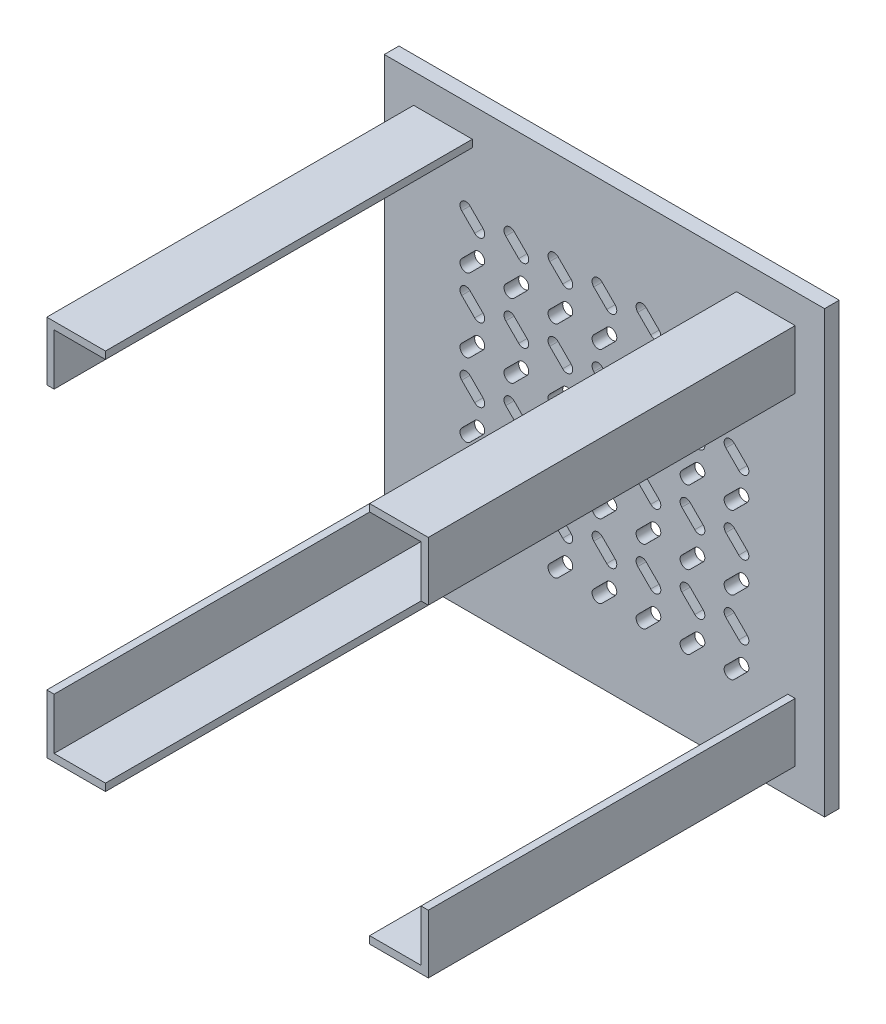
from build123d import *

# Parameters (mm, degrees)
SKETCH2_W               = 300
SKETCH2_H               = 10
BOSS_EXTRUDE1_DEPTH     = 150
BOSS_EXTRUDE2_DEPTH     = 250
CUT_EXTRUDE1_REACH      = 337.559
LPATTERN1_COUNT         = 4
LPATTERN1_PITCH         = 50
LPATTERN2_COUNT         = 7
LPATTERN2_PITCH         = 30
LPATTERN2_COPY_1_REACH  = 337.559
LPATTERN2_COPY_2_REACH  = 337.559
LPATTERN2_COPY_3_REACH  = 337.559
LPATTERN2_COPY_4_REACH  = 337.559
LPATTERN2_COPY_5_REACH  = 337.559
LPATTERN2_COPY_6_REACH  = 337.559
LPATTERN2_COPY_7_REACH  = 337.559
LPATTERN2_COPY_8_REACH  = 337.559
LPATTERN2_COPY_9_REACH  = 337.559
LPATTERN2_COPY_10_REACH = 337.559
LPATTERN2_COPY_11_REACH = 337.559
LPATTERN2_COPY_12_REACH = 337.559
LPATTERN2_COPY_13_REACH = 337.559
LPATTERN2_COPY_14_REACH = 337.559
LPATTERN2_COPY_15_REACH = 337.559
LPATTERN2_COPY_16_REACH = 337.559
LPATTERN2_COPY_17_REACH = 337.559
LPATTERN2_COPY_18_REACH = 337.559


with BuildPart() as part:
    # Sketch2 → Boss-Extrude1 (new, symmetric)
    with BuildSketch(Plane(origin=(0, 0, 0), x_dir=(1, 0, 0), z_dir=(0, 1, 0))):
        with Locations((0, 5)):
            Rectangle(SKETCH2_W, SKETCH2_H)
    extrude(amount=BOSS_EXTRUDE1_DEPTH, both=True)

    # Sketch4 → Boss-Extrude2 (add)
    with BuildSketch(Plane.XY):
        Polygon((130, -90), (130, -130), (90, -130), (90, -125), (125, -125), (125, -90), align=None)
        Polygon((-90, -130), (-90, -125), (-125, -125), (-125, -90), (-130, -90), (-130, -130), align=None)
        Polygon((-90, 130), (-90, 125), (-125, 125), (-125, 90), (-130, 90), (-130, 130), align=None)
        Polygon((130, 130), (90, 130), (90, 125), (125, 125), (125, 90), (130, 90), align=None)
    extrude(amount=BOSS_EXTRUDE2_DEPTH)

    # Sketch5 → Cut-Extrude1 (cut, up to next)
    with BuildSketch(Plane(origin=(0, 0, -10), x_dir=(-1, 0, 0), z_dir=(0, 0, -1)), mode=Mode.PRIVATE) as cut_extrude1_sk1:
        with BuildLine():
            Line((97.247844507, 84.176693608), (88.409009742, 75.337858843))
            ThreePointArc((88.409009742, 75.337858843), (82.752155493, 75.337858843), (82.752155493, 80.994713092))
            Line((82.752155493, 80.994713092), (91.590990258, 89.833547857))
            ThreePointArc((91.590990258, 89.833547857), (97.247844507, 89.833547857), (97.247844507, 84.176693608))
        make_face()
    cut_extrude1_tool1 = extrude(cut_extrude1_sk1.sketch, amount=-CUT_EXTRUDE1_REACH, mode=Mode.PRIVATE) & part.part
    # Sketch5 → Cut-Extrude1 (cut, up to next)
    with BuildSketch(Plane(origin=(0, 0, -10), x_dir=(-1, 0, 0), z_dir=(0, 0, -1)), mode=Mode.PRIVATE) as cut_extrude1_sk2:
        with BuildLine():
            Line((88.409009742, 64.833547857), (97.247844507, 55.994713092))
            ThreePointArc((97.247844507, 55.994713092), (97.247844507, 50.337858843), (91.590990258, 50.337858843))
            Line((91.590990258, 50.337858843), (82.752155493, 59.176693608))
            ThreePointArc((82.752155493, 59.176693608), (82.752155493, 64.833547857), (88.409009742, 64.833547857))
        make_face()
    cut_extrude1_tool2 = extrude(cut_extrude1_sk2.sketch, amount=-CUT_EXTRUDE1_REACH, mode=Mode.PRIVATE) & part.part
    cut_extrude1_1 = cut_extrude1_tool1.solids().sort_by_distance((-90, 82.585703, -10))[0]
    add(cut_extrude1_1, mode=Mode.SUBTRACT)
    cut_extrude1_2 = cut_extrude1_tool2.solids().sort_by_distance((-90, 57.585703, -10))[0]
    add(cut_extrude1_2, mode=Mode.SUBTRACT)
    cut_extrude1 = cut_extrude1_1 + cut_extrude1_2  # Cut-Extrude1 as one shape, for the pattern or mirror that repeats it

    # LPattern1: Cut-Extrude1 ×4
    with Locations(*[(0, -i * LPATTERN1_PITCH, 0) for i in range(1, LPATTERN1_COUNT)]):
        add(cut_extrude1, mode=Mode.SUBTRACT)

    # LPattern2: Cut-Extrude1 ×7
    with Locations(*[(i * LPATTERN2_PITCH, 0, 0) for i in range(1, LPATTERN2_COUNT)]):
        add(cut_extrude1, mode=Mode.SUBTRACT)

    # LPattern2 copy 1 sketch → LPattern2 copy 1 (cut, up to next)
    with BuildSketch(Plane(origin=(30, -50, -10), x_dir=(-1, 0, 0), z_dir=(0, 0, -1)), mode=Mode.PRIVATE) as lpattern2_copy_1_sk1:
        with BuildLine():
            Line((97.247844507, 84.176693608), (88.409009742, 75.337858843))
            ThreePointArc((88.409009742, 75.337858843), (82.752155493, 75.337858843), (82.752155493, 80.994713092))
            Line((82.752155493, 80.994713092), (91.590990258, 89.833547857))
            ThreePointArc((91.590990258, 89.833547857), (97.247844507, 89.833547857), (97.247844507, 84.176693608))
        make_face()
    lpattern2_copy_1_tool1 = extrude(lpattern2_copy_1_sk1.sketch, amount=-LPATTERN2_COPY_1_REACH, mode=Mode.PRIVATE) & part.part
    # LPattern2 copy 1 sketch → LPattern2 copy 1 (cut, up to next)
    with BuildSketch(Plane(origin=(30, -50, -10), x_dir=(-1, 0, 0), z_dir=(0, 0, -1)), mode=Mode.PRIVATE) as lpattern2_copy_1_sk2:
        with BuildLine():
            Line((88.409009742, 64.833547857), (97.247844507, 55.994713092))
            ThreePointArc((97.247844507, 55.994713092), (97.247844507, 50.337858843), (91.590990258, 50.337858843))
            Line((91.590990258, 50.337858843), (82.752155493, 59.176693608))
            ThreePointArc((82.752155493, 59.176693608), (82.752155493, 64.833547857), (88.409009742, 64.833547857))
        make_face()
    lpattern2_copy_1_tool2 = extrude(lpattern2_copy_1_sk2.sketch, amount=-LPATTERN2_COPY_1_REACH, mode=Mode.PRIVATE) & part.part
    add(lpattern2_copy_1_tool1.solids().sort_by_distance((-60, 32.585703, -10))[0], mode=Mode.SUBTRACT)
    add(lpattern2_copy_1_tool2.solids().sort_by_distance((-60, 7.585703, -10))[0], mode=Mode.SUBTRACT)

    # LPattern2 copy 2 sketch → LPattern2 copy 2 (cut, up to next)
    with BuildSketch(Plane(origin=(60, -50, -10), x_dir=(-1, 0, 0), z_dir=(0, 0, -1)), mode=Mode.PRIVATE) as lpattern2_copy_2_sk1:
        with BuildLine():
            Line((97.247844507, 84.176693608), (88.409009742, 75.337858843))
            ThreePointArc((88.409009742, 75.337858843), (82.752155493, 75.337858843), (82.752155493, 80.994713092))
            Line((82.752155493, 80.994713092), (91.590990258, 89.833547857))
            ThreePointArc((91.590990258, 89.833547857), (97.247844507, 89.833547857), (97.247844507, 84.176693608))
        make_face()
    lpattern2_copy_2_tool1 = extrude(lpattern2_copy_2_sk1.sketch, amount=-LPATTERN2_COPY_2_REACH, mode=Mode.PRIVATE) & part.part
    # LPattern2 copy 2 sketch → LPattern2 copy 2 (cut, up to next)
    with BuildSketch(Plane(origin=(60, -50, -10), x_dir=(-1, 0, 0), z_dir=(0, 0, -1)), mode=Mode.PRIVATE) as lpattern2_copy_2_sk2:
        with BuildLine():
            Line((88.409009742, 64.833547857), (97.247844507, 55.994713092))
            ThreePointArc((97.247844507, 55.994713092), (97.247844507, 50.337858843), (91.590990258, 50.337858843))
            Line((91.590990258, 50.337858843), (82.752155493, 59.176693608))
            ThreePointArc((82.752155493, 59.176693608), (82.752155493, 64.833547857), (88.409009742, 64.833547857))
        make_face()
    lpattern2_copy_2_tool2 = extrude(lpattern2_copy_2_sk2.sketch, amount=-LPATTERN2_COPY_2_REACH, mode=Mode.PRIVATE) & part.part
    add(lpattern2_copy_2_tool1.solids().sort_by_distance((-30, 32.585703, -10))[0], mode=Mode.SUBTRACT)
    add(lpattern2_copy_2_tool2.solids().sort_by_distance((-30, 7.585703, -10))[0], mode=Mode.SUBTRACT)

    # LPattern2 copy 3 sketch → LPattern2 copy 3 (cut, up to next)
    with BuildSketch(Plane(origin=(90, -50, -10), x_dir=(-1, 0, 0), z_dir=(0, 0, -1)), mode=Mode.PRIVATE) as lpattern2_copy_3_sk1:
        with BuildLine():
            Line((97.247844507, 84.176693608), (88.409009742, 75.337858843))
            ThreePointArc((88.409009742, 75.337858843), (82.752155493, 75.337858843), (82.752155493, 80.994713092))
            Line((82.752155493, 80.994713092), (91.590990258, 89.833547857))
            ThreePointArc((91.590990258, 89.833547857), (97.247844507, 89.833547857), (97.247844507, 84.176693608))
        make_face()
    lpattern2_copy_3_tool1 = extrude(lpattern2_copy_3_sk1.sketch, amount=-LPATTERN2_COPY_3_REACH, mode=Mode.PRIVATE) & part.part
    # LPattern2 copy 3 sketch → LPattern2 copy 3 (cut, up to next)
    with BuildSketch(Plane(origin=(90, -50, -10), x_dir=(-1, 0, 0), z_dir=(0, 0, -1)), mode=Mode.PRIVATE) as lpattern2_copy_3_sk2:
        with BuildLine():
            Line((88.409009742, 64.833547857), (97.247844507, 55.994713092))
            ThreePointArc((97.247844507, 55.994713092), (97.247844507, 50.337858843), (91.590990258, 50.337858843))
            Line((91.590990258, 50.337858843), (82.752155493, 59.176693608))
            ThreePointArc((82.752155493, 59.176693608), (82.752155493, 64.833547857), (88.409009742, 64.833547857))
        make_face()
    lpattern2_copy_3_tool2 = extrude(lpattern2_copy_3_sk2.sketch, amount=-LPATTERN2_COPY_3_REACH, mode=Mode.PRIVATE) & part.part
    add(lpattern2_copy_3_tool1.solids().sort_by_distance((0, 32.585703, -10))[0], mode=Mode.SUBTRACT)
    add(lpattern2_copy_3_tool2.solids().sort_by_distance((0, 7.585703, -10))[0], mode=Mode.SUBTRACT)

    # LPattern2 copy 4 sketch → LPattern2 copy 4 (cut, up to next)
    with BuildSketch(Plane(origin=(120, -50, -10), x_dir=(-1, 0, 0), z_dir=(0, 0, -1)), mode=Mode.PRIVATE) as lpattern2_copy_4_sk1:
        with BuildLine():
            Line((97.247844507, 84.176693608), (88.409009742, 75.337858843))
            ThreePointArc((88.409009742, 75.337858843), (82.752155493, 75.337858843), (82.752155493, 80.994713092))
            Line((82.752155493, 80.994713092), (91.590990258, 89.833547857))
            ThreePointArc((91.590990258, 89.833547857), (97.247844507, 89.833547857), (97.247844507, 84.176693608))
        make_face()
    lpattern2_copy_4_tool1 = extrude(lpattern2_copy_4_sk1.sketch, amount=-LPATTERN2_COPY_4_REACH, mode=Mode.PRIVATE) & part.part
    # LPattern2 copy 4 sketch → LPattern2 copy 4 (cut, up to next)
    with BuildSketch(Plane(origin=(120, -50, -10), x_dir=(-1, 0, 0), z_dir=(0, 0, -1)), mode=Mode.PRIVATE) as lpattern2_copy_4_sk2:
        with BuildLine():
            Line((88.409009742, 64.833547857), (97.247844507, 55.994713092))
            ThreePointArc((97.247844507, 55.994713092), (97.247844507, 50.337858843), (91.590990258, 50.337858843))
            Line((91.590990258, 50.337858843), (82.752155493, 59.176693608))
            ThreePointArc((82.752155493, 59.176693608), (82.752155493, 64.833547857), (88.409009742, 64.833547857))
        make_face()
    lpattern2_copy_4_tool2 = extrude(lpattern2_copy_4_sk2.sketch, amount=-LPATTERN2_COPY_4_REACH, mode=Mode.PRIVATE) & part.part
    add(lpattern2_copy_4_tool1.solids().sort_by_distance((30, 32.585703, -10))[0], mode=Mode.SUBTRACT)
    add(lpattern2_copy_4_tool2.solids().sort_by_distance((30, 7.585703, -10))[0], mode=Mode.SUBTRACT)

    # LPattern2 copy 5 sketch → LPattern2 copy 5 (cut, up to next)
    with BuildSketch(Plane(origin=(150, -50, -10), x_dir=(-1, 0, 0), z_dir=(0, 0, -1)), mode=Mode.PRIVATE) as lpattern2_copy_5_sk1:
        with BuildLine():
            Line((97.247844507, 84.176693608), (88.409009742, 75.337858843))
            ThreePointArc((88.409009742, 75.337858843), (82.752155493, 75.337858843), (82.752155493, 80.994713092))
            Line((82.752155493, 80.994713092), (91.590990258, 89.833547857))
            ThreePointArc((91.590990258, 89.833547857), (97.247844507, 89.833547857), (97.247844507, 84.176693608))
        make_face()
    lpattern2_copy_5_tool1 = extrude(lpattern2_copy_5_sk1.sketch, amount=-LPATTERN2_COPY_5_REACH, mode=Mode.PRIVATE) & part.part
    # LPattern2 copy 5 sketch → LPattern2 copy 5 (cut, up to next)
    with BuildSketch(Plane(origin=(150, -50, -10), x_dir=(-1, 0, 0), z_dir=(0, 0, -1)), mode=Mode.PRIVATE) as lpattern2_copy_5_sk2:
        with BuildLine():
            Line((88.409009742, 64.833547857), (97.247844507, 55.994713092))
            ThreePointArc((97.247844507, 55.994713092), (97.247844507, 50.337858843), (91.590990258, 50.337858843))
            Line((91.590990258, 50.337858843), (82.752155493, 59.176693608))
            ThreePointArc((82.752155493, 59.176693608), (82.752155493, 64.833547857), (88.409009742, 64.833547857))
        make_face()
    lpattern2_copy_5_tool2 = extrude(lpattern2_copy_5_sk2.sketch, amount=-LPATTERN2_COPY_5_REACH, mode=Mode.PRIVATE) & part.part
    add(lpattern2_copy_5_tool1.solids().sort_by_distance((60, 32.585703, -10))[0], mode=Mode.SUBTRACT)
    add(lpattern2_copy_5_tool2.solids().sort_by_distance((60, 7.585703, -10))[0], mode=Mode.SUBTRACT)

    # LPattern2 copy 6 sketch → LPattern2 copy 6 (cut, up to next)
    with BuildSketch(Plane(origin=(180, -50, -10), x_dir=(-1, 0, 0), z_dir=(0, 0, -1)), mode=Mode.PRIVATE) as lpattern2_copy_6_sk1:
        with BuildLine():
            Line((97.247844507, 84.176693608), (88.409009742, 75.337858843))
            ThreePointArc((88.409009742, 75.337858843), (82.752155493, 75.337858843), (82.752155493, 80.994713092))
            Line((82.752155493, 80.994713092), (91.590990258, 89.833547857))
            ThreePointArc((91.590990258, 89.833547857), (97.247844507, 89.833547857), (97.247844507, 84.176693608))
        make_face()
    lpattern2_copy_6_tool1 = extrude(lpattern2_copy_6_sk1.sketch, amount=-LPATTERN2_COPY_6_REACH, mode=Mode.PRIVATE) & part.part
    # LPattern2 copy 6 sketch → LPattern2 copy 6 (cut, up to next)
    with BuildSketch(Plane(origin=(180, -50, -10), x_dir=(-1, 0, 0), z_dir=(0, 0, -1)), mode=Mode.PRIVATE) as lpattern2_copy_6_sk2:
        with BuildLine():
            Line((88.409009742, 64.833547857), (97.247844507, 55.994713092))
            ThreePointArc((97.247844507, 55.994713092), (97.247844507, 50.337858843), (91.590990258, 50.337858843))
            Line((91.590990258, 50.337858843), (82.752155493, 59.176693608))
            ThreePointArc((82.752155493, 59.176693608), (82.752155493, 64.833547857), (88.409009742, 64.833547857))
        make_face()
    lpattern2_copy_6_tool2 = extrude(lpattern2_copy_6_sk2.sketch, amount=-LPATTERN2_COPY_6_REACH, mode=Mode.PRIVATE) & part.part
    add(lpattern2_copy_6_tool1.solids().sort_by_distance((90, 32.585703, -10))[0], mode=Mode.SUBTRACT)
    add(lpattern2_copy_6_tool2.solids().sort_by_distance((90, 7.585703, -10))[0], mode=Mode.SUBTRACT)

    # LPattern2 copy 7 sketch → LPattern2 copy 7 (cut, up to next)
    with BuildSketch(Plane(origin=(30, -100, -10), x_dir=(-1, 0, 0), z_dir=(0, 0, -1)), mode=Mode.PRIVATE) as lpattern2_copy_7_sk1:
        with BuildLine():
            Line((97.247844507, 84.176693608), (88.409009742, 75.337858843))
            ThreePointArc((88.409009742, 75.337858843), (82.752155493, 75.337858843), (82.752155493, 80.994713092))
            Line((82.752155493, 80.994713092), (91.590990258, 89.833547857))
            ThreePointArc((91.590990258, 89.833547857), (97.247844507, 89.833547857), (97.247844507, 84.176693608))
        make_face()
    lpattern2_copy_7_tool1 = extrude(lpattern2_copy_7_sk1.sketch, amount=-LPATTERN2_COPY_7_REACH, mode=Mode.PRIVATE) & part.part
    # LPattern2 copy 7 sketch → LPattern2 copy 7 (cut, up to next)
    with BuildSketch(Plane(origin=(30, -100, -10), x_dir=(-1, 0, 0), z_dir=(0, 0, -1)), mode=Mode.PRIVATE) as lpattern2_copy_7_sk2:
        with BuildLine():
            Line((88.409009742, 64.833547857), (97.247844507, 55.994713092))
            ThreePointArc((97.247844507, 55.994713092), (97.247844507, 50.337858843), (91.590990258, 50.337858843))
            Line((91.590990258, 50.337858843), (82.752155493, 59.176693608))
            ThreePointArc((82.752155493, 59.176693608), (82.752155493, 64.833547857), (88.409009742, 64.833547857))
        make_face()
    lpattern2_copy_7_tool2 = extrude(lpattern2_copy_7_sk2.sketch, amount=-LPATTERN2_COPY_7_REACH, mode=Mode.PRIVATE) & part.part
    add(lpattern2_copy_7_tool1.solids().sort_by_distance((-60, -17.414297, -10))[0], mode=Mode.SUBTRACT)
    add(lpattern2_copy_7_tool2.solids().sort_by_distance((-60, -42.414297, -10))[0], mode=Mode.SUBTRACT)

    # LPattern2 copy 8 sketch → LPattern2 copy 8 (cut, up to next)
    with BuildSketch(Plane(origin=(60, -100, -10), x_dir=(-1, 0, 0), z_dir=(0, 0, -1)), mode=Mode.PRIVATE) as lpattern2_copy_8_sk1:
        with BuildLine():
            Line((97.247844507, 84.176693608), (88.409009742, 75.337858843))
            ThreePointArc((88.409009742, 75.337858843), (82.752155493, 75.337858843), (82.752155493, 80.994713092))
            Line((82.752155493, 80.994713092), (91.590990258, 89.833547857))
            ThreePointArc((91.590990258, 89.833547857), (97.247844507, 89.833547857), (97.247844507, 84.176693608))
        make_face()
    lpattern2_copy_8_tool1 = extrude(lpattern2_copy_8_sk1.sketch, amount=-LPATTERN2_COPY_8_REACH, mode=Mode.PRIVATE) & part.part
    # LPattern2 copy 8 sketch → LPattern2 copy 8 (cut, up to next)
    with BuildSketch(Plane(origin=(60, -100, -10), x_dir=(-1, 0, 0), z_dir=(0, 0, -1)), mode=Mode.PRIVATE) as lpattern2_copy_8_sk2:
        with BuildLine():
            Line((88.409009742, 64.833547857), (97.247844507, 55.994713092))
            ThreePointArc((97.247844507, 55.994713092), (97.247844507, 50.337858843), (91.590990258, 50.337858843))
            Line((91.590990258, 50.337858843), (82.752155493, 59.176693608))
            ThreePointArc((82.752155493, 59.176693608), (82.752155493, 64.833547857), (88.409009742, 64.833547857))
        make_face()
    lpattern2_copy_8_tool2 = extrude(lpattern2_copy_8_sk2.sketch, amount=-LPATTERN2_COPY_8_REACH, mode=Mode.PRIVATE) & part.part
    add(lpattern2_copy_8_tool1.solids().sort_by_distance((-30, -17.414297, -10))[0], mode=Mode.SUBTRACT)
    add(lpattern2_copy_8_tool2.solids().sort_by_distance((-30, -42.414297, -10))[0], mode=Mode.SUBTRACT)

    # LPattern2 copy 9 sketch → LPattern2 copy 9 (cut, up to next)
    with BuildSketch(Plane(origin=(90, -100, -10), x_dir=(-1, 0, 0), z_dir=(0, 0, -1)), mode=Mode.PRIVATE) as lpattern2_copy_9_sk1:
        with BuildLine():
            Line((97.247844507, 84.176693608), (88.409009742, 75.337858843))
            ThreePointArc((88.409009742, 75.337858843), (82.752155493, 75.337858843), (82.752155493, 80.994713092))
            Line((82.752155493, 80.994713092), (91.590990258, 89.833547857))
            ThreePointArc((91.590990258, 89.833547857), (97.247844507, 89.833547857), (97.247844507, 84.176693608))
        make_face()
    lpattern2_copy_9_tool1 = extrude(lpattern2_copy_9_sk1.sketch, amount=-LPATTERN2_COPY_9_REACH, mode=Mode.PRIVATE) & part.part
    # LPattern2 copy 9 sketch → LPattern2 copy 9 (cut, up to next)
    with BuildSketch(Plane(origin=(90, -100, -10), x_dir=(-1, 0, 0), z_dir=(0, 0, -1)), mode=Mode.PRIVATE) as lpattern2_copy_9_sk2:
        with BuildLine():
            Line((88.409009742, 64.833547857), (97.247844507, 55.994713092))
            ThreePointArc((97.247844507, 55.994713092), (97.247844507, 50.337858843), (91.590990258, 50.337858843))
            Line((91.590990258, 50.337858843), (82.752155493, 59.176693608))
            ThreePointArc((82.752155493, 59.176693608), (82.752155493, 64.833547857), (88.409009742, 64.833547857))
        make_face()
    lpattern2_copy_9_tool2 = extrude(lpattern2_copy_9_sk2.sketch, amount=-LPATTERN2_COPY_9_REACH, mode=Mode.PRIVATE) & part.part
    add(lpattern2_copy_9_tool1.solids().sort_by_distance((0, -17.414297, -10))[0], mode=Mode.SUBTRACT)
    add(lpattern2_copy_9_tool2.solids().sort_by_distance((0, -42.414297, -10))[0], mode=Mode.SUBTRACT)

    # LPattern2 copy 10 sketch → LPattern2 copy 10 (cut, up to next)
    with BuildSketch(Plane(origin=(120, -100, -10), x_dir=(-1, 0, 0), z_dir=(0, 0, -1)), mode=Mode.PRIVATE) as lpattern2_copy_10_sk1:
        with BuildLine():
            Line((97.247844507, 84.176693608), (88.409009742, 75.337858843))
            ThreePointArc((88.409009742, 75.337858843), (82.752155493, 75.337858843), (82.752155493, 80.994713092))
            Line((82.752155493, 80.994713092), (91.590990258, 89.833547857))
            ThreePointArc((91.590990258, 89.833547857), (97.247844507, 89.833547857), (97.247844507, 84.176693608))
        make_face()
    lpattern2_copy_10_tool1 = extrude(lpattern2_copy_10_sk1.sketch, amount=-LPATTERN2_COPY_10_REACH, mode=Mode.PRIVATE) & part.part
    # LPattern2 copy 10 sketch → LPattern2 copy 10 (cut, up to next)
    with BuildSketch(Plane(origin=(120, -100, -10), x_dir=(-1, 0, 0), z_dir=(0, 0, -1)), mode=Mode.PRIVATE) as lpattern2_copy_10_sk2:
        with BuildLine():
            Line((88.409009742, 64.833547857), (97.247844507, 55.994713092))
            ThreePointArc((97.247844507, 55.994713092), (97.247844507, 50.337858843), (91.590990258, 50.337858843))
            Line((91.590990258, 50.337858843), (82.752155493, 59.176693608))
            ThreePointArc((82.752155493, 59.176693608), (82.752155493, 64.833547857), (88.409009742, 64.833547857))
        make_face()
    lpattern2_copy_10_tool2 = extrude(lpattern2_copy_10_sk2.sketch, amount=-LPATTERN2_COPY_10_REACH, mode=Mode.PRIVATE) & part.part
    add(lpattern2_copy_10_tool1.solids().sort_by_distance((30, -17.414297, -10))[0], mode=Mode.SUBTRACT)
    add(lpattern2_copy_10_tool2.solids().sort_by_distance((30, -42.414297, -10))[0], mode=Mode.SUBTRACT)

    # LPattern2 copy 11 sketch → LPattern2 copy 11 (cut, up to next)
    with BuildSketch(Plane(origin=(150, -100, -10), x_dir=(-1, 0, 0), z_dir=(0, 0, -1)), mode=Mode.PRIVATE) as lpattern2_copy_11_sk1:
        with BuildLine():
            Line((97.247844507, 84.176693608), (88.409009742, 75.337858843))
            ThreePointArc((88.409009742, 75.337858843), (82.752155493, 75.337858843), (82.752155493, 80.994713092))
            Line((82.752155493, 80.994713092), (91.590990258, 89.833547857))
            ThreePointArc((91.590990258, 89.833547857), (97.247844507, 89.833547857), (97.247844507, 84.176693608))
        make_face()
    lpattern2_copy_11_tool1 = extrude(lpattern2_copy_11_sk1.sketch, amount=-LPATTERN2_COPY_11_REACH, mode=Mode.PRIVATE) & part.part
    # LPattern2 copy 11 sketch → LPattern2 copy 11 (cut, up to next)
    with BuildSketch(Plane(origin=(150, -100, -10), x_dir=(-1, 0, 0), z_dir=(0, 0, -1)), mode=Mode.PRIVATE) as lpattern2_copy_11_sk2:
        with BuildLine():
            Line((88.409009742, 64.833547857), (97.247844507, 55.994713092))
            ThreePointArc((97.247844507, 55.994713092), (97.247844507, 50.337858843), (91.590990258, 50.337858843))
            Line((91.590990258, 50.337858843), (82.752155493, 59.176693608))
            ThreePointArc((82.752155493, 59.176693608), (82.752155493, 64.833547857), (88.409009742, 64.833547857))
        make_face()
    lpattern2_copy_11_tool2 = extrude(lpattern2_copy_11_sk2.sketch, amount=-LPATTERN2_COPY_11_REACH, mode=Mode.PRIVATE) & part.part
    add(lpattern2_copy_11_tool1.solids().sort_by_distance((60, -17.414297, -10))[0], mode=Mode.SUBTRACT)
    add(lpattern2_copy_11_tool2.solids().sort_by_distance((60, -42.414297, -10))[0], mode=Mode.SUBTRACT)

    # LPattern2 copy 12 sketch → LPattern2 copy 12 (cut, up to next)
    with BuildSketch(Plane(origin=(180, -100, -10), x_dir=(-1, 0, 0), z_dir=(0, 0, -1)), mode=Mode.PRIVATE) as lpattern2_copy_12_sk1:
        with BuildLine():
            Line((97.247844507, 84.176693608), (88.409009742, 75.337858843))
            ThreePointArc((88.409009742, 75.337858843), (82.752155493, 75.337858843), (82.752155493, 80.994713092))
            Line((82.752155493, 80.994713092), (91.590990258, 89.833547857))
            ThreePointArc((91.590990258, 89.833547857), (97.247844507, 89.833547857), (97.247844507, 84.176693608))
        make_face()
    lpattern2_copy_12_tool1 = extrude(lpattern2_copy_12_sk1.sketch, amount=-LPATTERN2_COPY_12_REACH, mode=Mode.PRIVATE) & part.part
    # LPattern2 copy 12 sketch → LPattern2 copy 12 (cut, up to next)
    with BuildSketch(Plane(origin=(180, -100, -10), x_dir=(-1, 0, 0), z_dir=(0, 0, -1)), mode=Mode.PRIVATE) as lpattern2_copy_12_sk2:
        with BuildLine():
            Line((88.409009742, 64.833547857), (97.247844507, 55.994713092))
            ThreePointArc((97.247844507, 55.994713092), (97.247844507, 50.337858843), (91.590990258, 50.337858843))
            Line((91.590990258, 50.337858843), (82.752155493, 59.176693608))
            ThreePointArc((82.752155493, 59.176693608), (82.752155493, 64.833547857), (88.409009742, 64.833547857))
        make_face()
    lpattern2_copy_12_tool2 = extrude(lpattern2_copy_12_sk2.sketch, amount=-LPATTERN2_COPY_12_REACH, mode=Mode.PRIVATE) & part.part
    add(lpattern2_copy_12_tool1.solids().sort_by_distance((90, -17.414297, -10))[0], mode=Mode.SUBTRACT)
    add(lpattern2_copy_12_tool2.solids().sort_by_distance((90, -42.414297, -10))[0], mode=Mode.SUBTRACT)

    # LPattern2 copy 13 sketch → LPattern2 copy 13 (cut, up to next)
    with BuildSketch(Plane(origin=(30, -150, -10), x_dir=(-1, 0, 0), z_dir=(0, 0, -1)), mode=Mode.PRIVATE) as lpattern2_copy_13_sk1:
        with BuildLine():
            Line((97.247844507, 84.176693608), (88.409009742, 75.337858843))
            ThreePointArc((88.409009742, 75.337858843), (82.752155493, 75.337858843), (82.752155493, 80.994713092))
            Line((82.752155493, 80.994713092), (91.590990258, 89.833547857))
            ThreePointArc((91.590990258, 89.833547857), (97.247844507, 89.833547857), (97.247844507, 84.176693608))
        make_face()
    lpattern2_copy_13_tool1 = extrude(lpattern2_copy_13_sk1.sketch, amount=-LPATTERN2_COPY_13_REACH, mode=Mode.PRIVATE) & part.part
    # LPattern2 copy 13 sketch → LPattern2 copy 13 (cut, up to next)
    with BuildSketch(Plane(origin=(30, -150, -10), x_dir=(-1, 0, 0), z_dir=(0, 0, -1)), mode=Mode.PRIVATE) as lpattern2_copy_13_sk2:
        with BuildLine():
            Line((88.409009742, 64.833547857), (97.247844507, 55.994713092))
            ThreePointArc((97.247844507, 55.994713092), (97.247844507, 50.337858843), (91.590990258, 50.337858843))
            Line((91.590990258, 50.337858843), (82.752155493, 59.176693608))
            ThreePointArc((82.752155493, 59.176693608), (82.752155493, 64.833547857), (88.409009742, 64.833547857))
        make_face()
    lpattern2_copy_13_tool2 = extrude(lpattern2_copy_13_sk2.sketch, amount=-LPATTERN2_COPY_13_REACH, mode=Mode.PRIVATE) & part.part
    add(lpattern2_copy_13_tool1.solids().sort_by_distance((-60, -67.414297, -10))[0], mode=Mode.SUBTRACT)
    add(lpattern2_copy_13_tool2.solids().sort_by_distance((-60, -92.414297, -10))[0], mode=Mode.SUBTRACT)

    # LPattern2 copy 14 sketch → LPattern2 copy 14 (cut, up to next)
    with BuildSketch(Plane(origin=(60, -150, -10), x_dir=(-1, 0, 0), z_dir=(0, 0, -1)), mode=Mode.PRIVATE) as lpattern2_copy_14_sk1:
        with BuildLine():
            Line((97.247844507, 84.176693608), (88.409009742, 75.337858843))
            ThreePointArc((88.409009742, 75.337858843), (82.752155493, 75.337858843), (82.752155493, 80.994713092))
            Line((82.752155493, 80.994713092), (91.590990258, 89.833547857))
            ThreePointArc((91.590990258, 89.833547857), (97.247844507, 89.833547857), (97.247844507, 84.176693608))
        make_face()
    lpattern2_copy_14_tool1 = extrude(lpattern2_copy_14_sk1.sketch, amount=-LPATTERN2_COPY_14_REACH, mode=Mode.PRIVATE) & part.part
    # LPattern2 copy 14 sketch → LPattern2 copy 14 (cut, up to next)
    with BuildSketch(Plane(origin=(60, -150, -10), x_dir=(-1, 0, 0), z_dir=(0, 0, -1)), mode=Mode.PRIVATE) as lpattern2_copy_14_sk2:
        with BuildLine():
            Line((88.409009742, 64.833547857), (97.247844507, 55.994713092))
            ThreePointArc((97.247844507, 55.994713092), (97.247844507, 50.337858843), (91.590990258, 50.337858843))
            Line((91.590990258, 50.337858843), (82.752155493, 59.176693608))
            ThreePointArc((82.752155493, 59.176693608), (82.752155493, 64.833547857), (88.409009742, 64.833547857))
        make_face()
    lpattern2_copy_14_tool2 = extrude(lpattern2_copy_14_sk2.sketch, amount=-LPATTERN2_COPY_14_REACH, mode=Mode.PRIVATE) & part.part
    add(lpattern2_copy_14_tool1.solids().sort_by_distance((-30, -67.414297, -10))[0], mode=Mode.SUBTRACT)
    add(lpattern2_copy_14_tool2.solids().sort_by_distance((-30, -92.414297, -10))[0], mode=Mode.SUBTRACT)

    # LPattern2 copy 15 sketch → LPattern2 copy 15 (cut, up to next)
    with BuildSketch(Plane(origin=(90, -150, -10), x_dir=(-1, 0, 0), z_dir=(0, 0, -1)), mode=Mode.PRIVATE) as lpattern2_copy_15_sk1:
        with BuildLine():
            Line((97.247844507, 84.176693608), (88.409009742, 75.337858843))
            ThreePointArc((88.409009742, 75.337858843), (82.752155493, 75.337858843), (82.752155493, 80.994713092))
            Line((82.752155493, 80.994713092), (91.590990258, 89.833547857))
            ThreePointArc((91.590990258, 89.833547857), (97.247844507, 89.833547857), (97.247844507, 84.176693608))
        make_face()
    lpattern2_copy_15_tool1 = extrude(lpattern2_copy_15_sk1.sketch, amount=-LPATTERN2_COPY_15_REACH, mode=Mode.PRIVATE) & part.part
    # LPattern2 copy 15 sketch → LPattern2 copy 15 (cut, up to next)
    with BuildSketch(Plane(origin=(90, -150, -10), x_dir=(-1, 0, 0), z_dir=(0, 0, -1)), mode=Mode.PRIVATE) as lpattern2_copy_15_sk2:
        with BuildLine():
            Line((88.409009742, 64.833547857), (97.247844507, 55.994713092))
            ThreePointArc((97.247844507, 55.994713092), (97.247844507, 50.337858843), (91.590990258, 50.337858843))
            Line((91.590990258, 50.337858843), (82.752155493, 59.176693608))
            ThreePointArc((82.752155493, 59.176693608), (82.752155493, 64.833547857), (88.409009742, 64.833547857))
        make_face()
    lpattern2_copy_15_tool2 = extrude(lpattern2_copy_15_sk2.sketch, amount=-LPATTERN2_COPY_15_REACH, mode=Mode.PRIVATE) & part.part
    add(lpattern2_copy_15_tool1.solids().sort_by_distance((0, -67.414297, -10))[0], mode=Mode.SUBTRACT)
    add(lpattern2_copy_15_tool2.solids().sort_by_distance((0, -92.414297, -10))[0], mode=Mode.SUBTRACT)

    # LPattern2 copy 16 sketch → LPattern2 copy 16 (cut, up to next)
    with BuildSketch(Plane(origin=(120, -150, -10), x_dir=(-1, 0, 0), z_dir=(0, 0, -1)), mode=Mode.PRIVATE) as lpattern2_copy_16_sk1:
        with BuildLine():
            Line((97.247844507, 84.176693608), (88.409009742, 75.337858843))
            ThreePointArc((88.409009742, 75.337858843), (82.752155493, 75.337858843), (82.752155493, 80.994713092))
            Line((82.752155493, 80.994713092), (91.590990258, 89.833547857))
            ThreePointArc((91.590990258, 89.833547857), (97.247844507, 89.833547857), (97.247844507, 84.176693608))
        make_face()
    lpattern2_copy_16_tool1 = extrude(lpattern2_copy_16_sk1.sketch, amount=-LPATTERN2_COPY_16_REACH, mode=Mode.PRIVATE) & part.part
    # LPattern2 copy 16 sketch → LPattern2 copy 16 (cut, up to next)
    with BuildSketch(Plane(origin=(120, -150, -10), x_dir=(-1, 0, 0), z_dir=(0, 0, -1)), mode=Mode.PRIVATE) as lpattern2_copy_16_sk2:
        with BuildLine():
            Line((88.409009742, 64.833547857), (97.247844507, 55.994713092))
            ThreePointArc((97.247844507, 55.994713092), (97.247844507, 50.337858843), (91.590990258, 50.337858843))
            Line((91.590990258, 50.337858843), (82.752155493, 59.176693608))
            ThreePointArc((82.752155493, 59.176693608), (82.752155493, 64.833547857), (88.409009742, 64.833547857))
        make_face()
    lpattern2_copy_16_tool2 = extrude(lpattern2_copy_16_sk2.sketch, amount=-LPATTERN2_COPY_16_REACH, mode=Mode.PRIVATE) & part.part
    add(lpattern2_copy_16_tool1.solids().sort_by_distance((30, -67.414297, -10))[0], mode=Mode.SUBTRACT)
    add(lpattern2_copy_16_tool2.solids().sort_by_distance((30, -92.414297, -10))[0], mode=Mode.SUBTRACT)

    # LPattern2 copy 17 sketch → LPattern2 copy 17 (cut, up to next)
    with BuildSketch(Plane(origin=(150, -150, -10), x_dir=(-1, 0, 0), z_dir=(0, 0, -1)), mode=Mode.PRIVATE) as lpattern2_copy_17_sk1:
        with BuildLine():
            Line((97.247844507, 84.176693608), (88.409009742, 75.337858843))
            ThreePointArc((88.409009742, 75.337858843), (82.752155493, 75.337858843), (82.752155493, 80.994713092))
            Line((82.752155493, 80.994713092), (91.590990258, 89.833547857))
            ThreePointArc((91.590990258, 89.833547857), (97.247844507, 89.833547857), (97.247844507, 84.176693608))
        make_face()
    lpattern2_copy_17_tool1 = extrude(lpattern2_copy_17_sk1.sketch, amount=-LPATTERN2_COPY_17_REACH, mode=Mode.PRIVATE) & part.part
    # LPattern2 copy 17 sketch → LPattern2 copy 17 (cut, up to next)
    with BuildSketch(Plane(origin=(150, -150, -10), x_dir=(-1, 0, 0), z_dir=(0, 0, -1)), mode=Mode.PRIVATE) as lpattern2_copy_17_sk2:
        with BuildLine():
            Line((88.409009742, 64.833547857), (97.247844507, 55.994713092))
            ThreePointArc((97.247844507, 55.994713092), (97.247844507, 50.337858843), (91.590990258, 50.337858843))
            Line((91.590990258, 50.337858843), (82.752155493, 59.176693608))
            ThreePointArc((82.752155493, 59.176693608), (82.752155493, 64.833547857), (88.409009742, 64.833547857))
        make_face()
    lpattern2_copy_17_tool2 = extrude(lpattern2_copy_17_sk2.sketch, amount=-LPATTERN2_COPY_17_REACH, mode=Mode.PRIVATE) & part.part
    add(lpattern2_copy_17_tool1.solids().sort_by_distance((60, -67.414297, -10))[0], mode=Mode.SUBTRACT)
    add(lpattern2_copy_17_tool2.solids().sort_by_distance((60, -92.414297, -10))[0], mode=Mode.SUBTRACT)

    # LPattern2 copy 18 sketch → LPattern2 copy 18 (cut, up to next)
    with BuildSketch(Plane(origin=(180, -150, -10), x_dir=(-1, 0, 0), z_dir=(0, 0, -1)), mode=Mode.PRIVATE) as lpattern2_copy_18_sk1:
        with BuildLine():
            Line((97.247844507, 84.176693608), (88.409009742, 75.337858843))
            ThreePointArc((88.409009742, 75.337858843), (82.752155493, 75.337858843), (82.752155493, 80.994713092))
            Line((82.752155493, 80.994713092), (91.590990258, 89.833547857))
            ThreePointArc((91.590990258, 89.833547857), (97.247844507, 89.833547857), (97.247844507, 84.176693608))
        make_face()
    lpattern2_copy_18_tool1 = extrude(lpattern2_copy_18_sk1.sketch, amount=-LPATTERN2_COPY_18_REACH, mode=Mode.PRIVATE) & part.part
    # LPattern2 copy 18 sketch → LPattern2 copy 18 (cut, up to next)
    with BuildSketch(Plane(origin=(180, -150, -10), x_dir=(-1, 0, 0), z_dir=(0, 0, -1)), mode=Mode.PRIVATE) as lpattern2_copy_18_sk2:
        with BuildLine():
            Line((88.409009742, 64.833547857), (97.247844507, 55.994713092))
            ThreePointArc((97.247844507, 55.994713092), (97.247844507, 50.337858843), (91.590990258, 50.337858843))
            Line((91.590990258, 50.337858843), (82.752155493, 59.176693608))
            ThreePointArc((82.752155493, 59.176693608), (82.752155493, 64.833547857), (88.409009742, 64.833547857))
        make_face()
    lpattern2_copy_18_tool2 = extrude(lpattern2_copy_18_sk2.sketch, amount=-LPATTERN2_COPY_18_REACH, mode=Mode.PRIVATE) & part.part
    add(lpattern2_copy_18_tool1.solids().sort_by_distance((90, -67.414297, -10))[0], mode=Mode.SUBTRACT)
    add(lpattern2_copy_18_tool2.solids().sort_by_distance((90, -92.414297, -10))[0], mode=Mode.SUBTRACT)


solid = part.part
